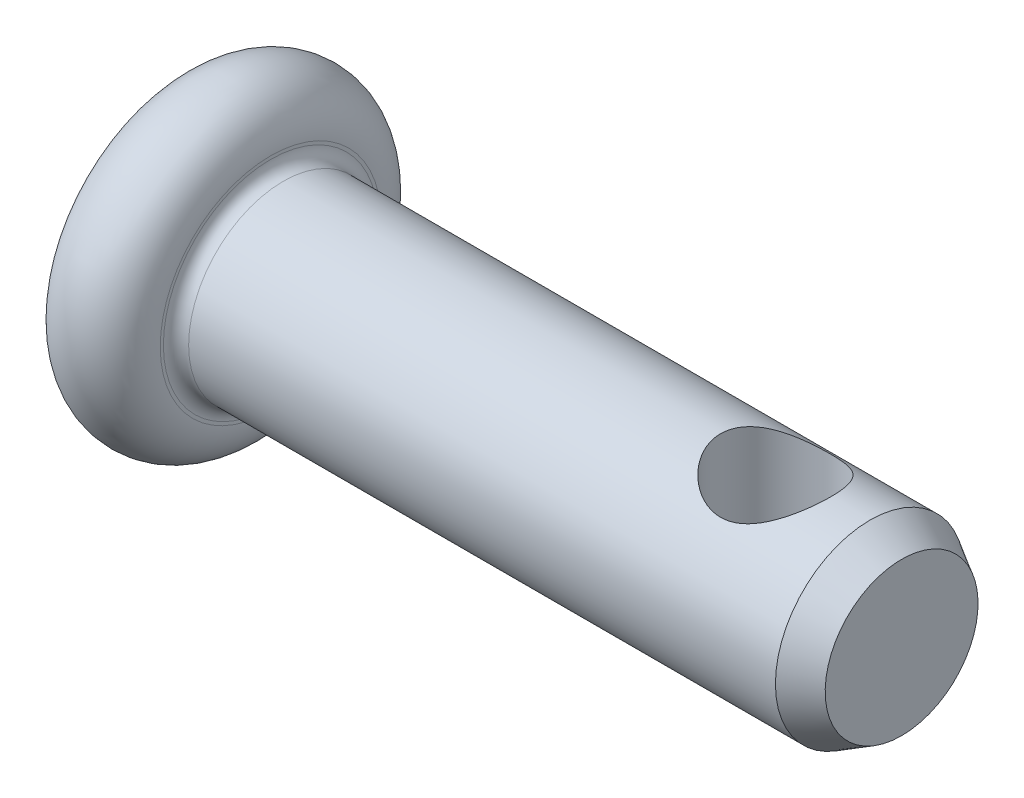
from build123d import *

# Parameters (mm, degrees)
CHAMFER1_R      = 0.2
HOLE_DEPTH      = 13.031209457
HOLE_DEPTH_BACK = 13.031209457
SKETCH2_R       = 0.87


with BuildPart() as part:
    # Sketch1 → BaseBody (revolve)
    with BuildSketch(Plane.XY, mode=Mode.PRIVATE) as basebody_sk:
        with BuildLine():
            Line((11.5, 0), (0, 0))
            Line((0, 0), (0, 1.75))
            ThreePointArc((0, 1.75), (0.75, 2.5), (1.5, 1.75))
            Line((1.5, 1.75), (1.5, 1.5))
            Line((1.5, 1.5), (11, 1.5))
            Line((11, 1.5), (11.5, 1.211324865))
            Line((11.5, 1.211324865), (11.5, 0))
        make_face()
    revolve(basebody_sk.sketch.rotate(Axis((-19.830028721, 0, 0), (1, 0, 0)), 180), axis=Axis((-19.830028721, 0, 0), (1, 0, 0)))

    # Chamfer1
    chamfer1_edges = [part.edges().sort_by_distance(p)[0] for p in [
        (1.5, 1.5, 0),
    ]]
    fillet(chamfer1_edges, radius=CHAMFER1_R)

    # Sketch2 → Hole (cut, two sides: drawn at the far end of the back side and taken through both)
    with BuildSketch(Plane(origin=(0, 0, 0), x_dir=(1, 0, 0), z_dir=(0, 1, 0)).offset(-HOLE_DEPTH_BACK)):
        with Locations(Location((9.5, 0, 0), (0, 0, 270))):
            Circle(SKETCH2_R)
    extrude(amount=HOLE_DEPTH + HOLE_DEPTH_BACK, mode=Mode.SUBTRACT)


solid = part.part
